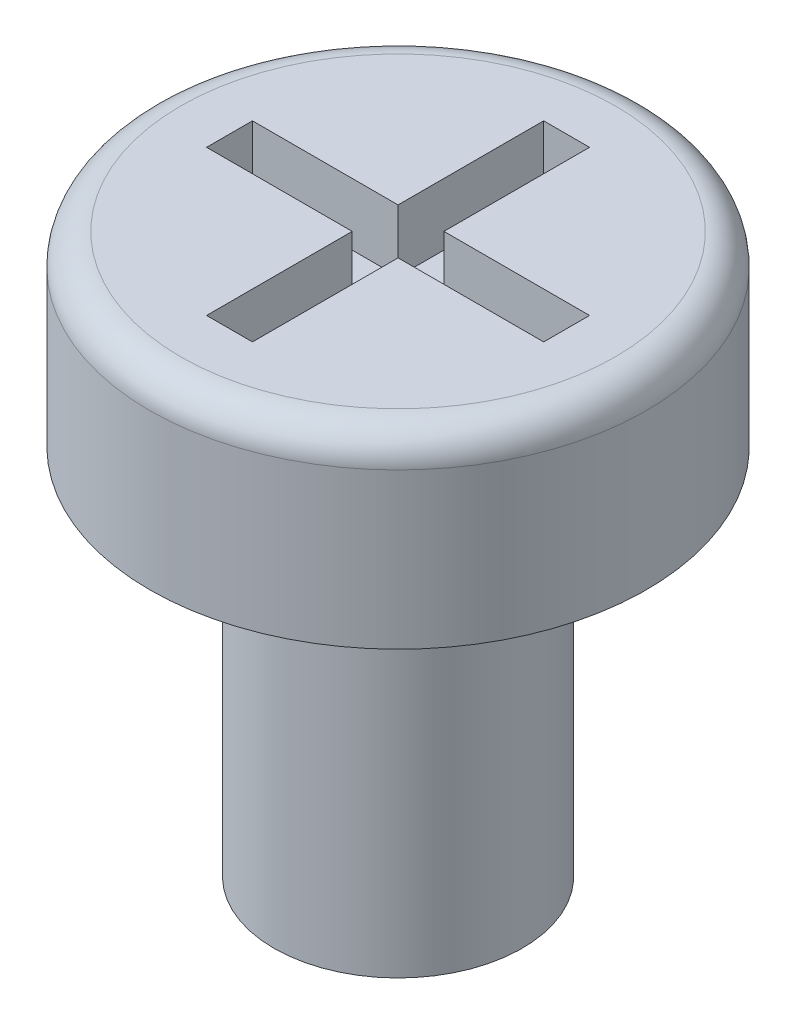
from build123d import *

# Parameters (mm, degrees)
SKETCH1_R           = 1
BOSS_EXTRUDE1_DEPTH = 3
SKETCH2_R           = 2
BOSS_EXTRUDE2_DEPTH = 1.5
FILLET1_R           = 0.25
CUT_EXTRUDE1_DEPTH  = 0.5


with BuildPart() as part:
    # Sketch1 → Boss-Extrude1 (new body)
    with BuildSketch(Plane(origin=(0, 0, 0), x_dir=(1, 0, 0), z_dir=(0, 1, 0))):
        with Locations(Location((0, 0, 0), (0, 0, 270))):
            Circle(SKETCH1_R)
    extrude(amount=BOSS_EXTRUDE1_DEPTH)

    # Sketch2 → Boss-Extrude2 (add)
    with BuildSketch(Plane(origin=(0, 3, 0), x_dir=(1, 0, 0), z_dir=(0, 1, 0))):
        with Locations(Location((0, 0, 0), (0, 0, 270))):
            Circle(SKETCH2_R)
    extrude(amount=BOSS_EXTRUDE2_DEPTH)

    # Fillet1
    fillet1_edges = [part.edges().sort_by_distance(p)[0] for p in [
        (0, 4.5, -2),
    ]]
    fillet(fillet1_edges, radius=FILLET1_R)

    # Sketch3 → Cut-Extrude1 (cut)
    with BuildSketch(Plane(origin=(0, 4.5, 0), x_dir=(1, 0, 0), z_dir=(0, 1, 0))):
        Polygon((-0.184631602, -1.357291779), (0.184631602, -1.357291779), (0.184631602, -0.184631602), (1.357291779, -0.184631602), (1.357291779, 0.184631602), (0.184631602, 0.184631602), (0.184631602, 1.357291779), (-0.184631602, 1.357291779), (-0.184631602, 0.184631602), (-1.357291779, 0.184631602), (-1.357291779, -0.184631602), (-0.184631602, -0.184631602), align=None)
    extrude(amount=-CUT_EXTRUDE1_DEPTH, mode=Mode.SUBTRACT)


solid = part.part
